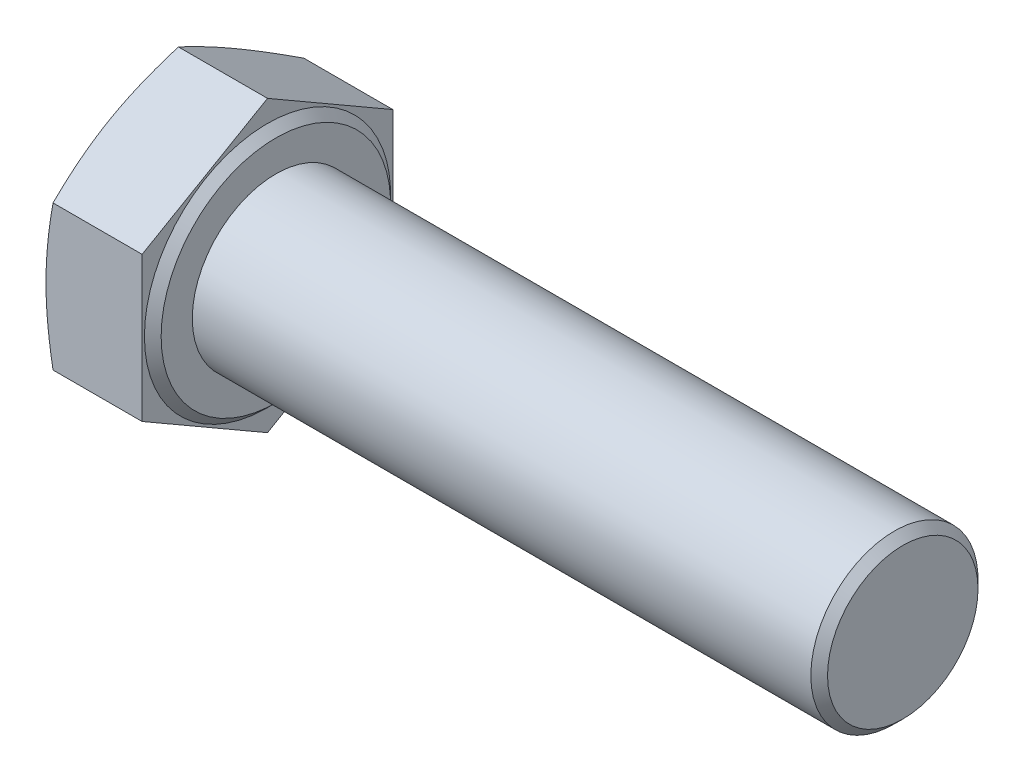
from build123d import *

# Parameters (mm, degrees)
BASEHEAD_DEPTH = 7.5
SKETCH5_R      = 6
BASEBODY_DEPTH = 45
CHAMFER1_SIZE  = 0.6


with BuildPart() as part:
    # Sketch2 → BaseHead (new body)
    with BuildSketch(Plane(origin=(0, 0, 0), x_dir=(0, 0, -1), z_dir=(1, 0, 0))):
        Polygon((0, -10.392304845), (9, -5.196152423), (9, 5.196152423), (0, 10.392304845), (-9, 5.196152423), (-9, -5.196152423), align=None)
    extrude(amount=BASEHEAD_DEPTH)

    # Sketch3 → BearingFace (revolve, cut)
    with BuildSketch(Plane.XY, mode=Mode.PRIVATE) as bearingface_sk:
        Polygon((7.5, 10.392304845), (7.5, 8.235), (6.9, 8.835), (6.9, 10.392304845), align=None)
    revolve(bearingface_sk.sketch.rotate(Axis((-0.957090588, 0, 0), (1, 0, 0)), 90), axis=Axis((-0.957090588, 0, 0), (1, 0, 0)), mode=Mode.SUBTRACT)

    # Sketch4 → HeadChamfer (revolve, cut)
    with BuildSketch(Plane.XY):
        Polygon((0, 10.392304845), (0.506757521, 10.392304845), (0, 9), align=None)
    revolve(axis=Axis((-0.493528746, 0, 0), (1, 0, 0)), mode=Mode.SUBTRACT)

    # Sketch5 → BaseBody (add)
    with BuildSketch(Plane(origin=(7.5, 0, 0), x_dir=(0, 0, -1), z_dir=(1, 0, 0))):
        with Locations(Location((0, 0, 0), (0, 0, 180))):
            Circle(SKETCH5_R)
    extrude(amount=BASEBODY_DEPTH)

    # Chamfer1
    chamfer1_edges = [part.edges().sort_by_distance(p)[0] for p in [
        (52.5, 0, -6),
    ]]
    chamfer(chamfer1_edges, length=CHAMFER1_SIZE)


solid = part.part
